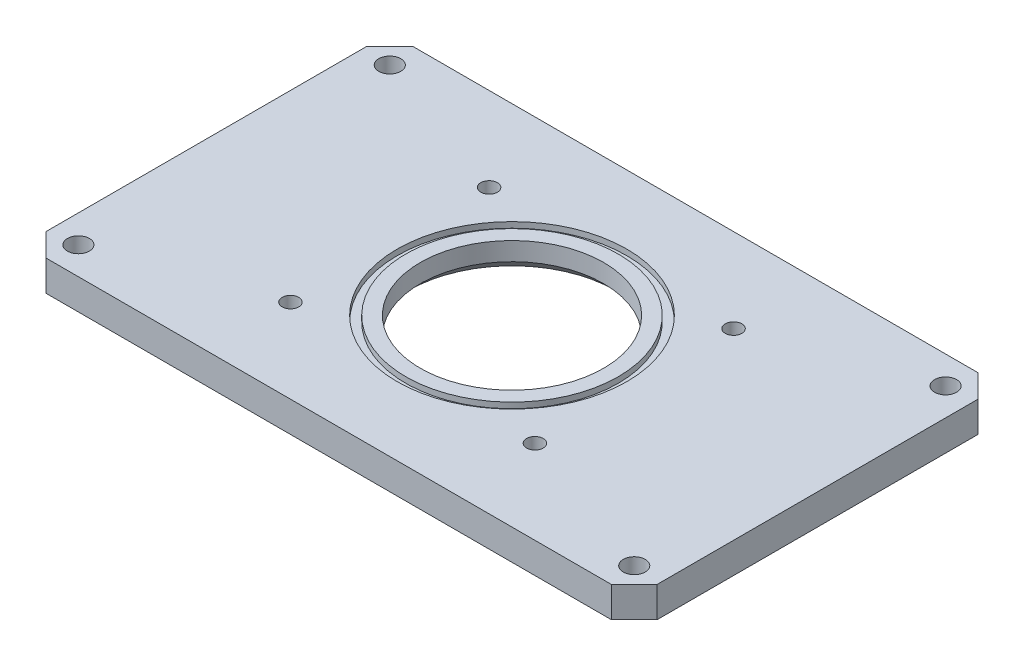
from build123d import *

# Parameters (mm, degrees)
SKETCH1_W                     = 127
SKETCH1_H                     = 76.2
BOSS_EXTRUDE1_DEPTH           = 3.175
CHAMFER1_SIZE                 = 4.7625
SKETCH7_R                     = 2.286
CUT_EXTRUDE1_DEPTH            = 75.324844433
MIRROR5_COPY_1_SKETCH_R       = 2.286
MIRROR5_COPY_1_DEPTH          = 75.324844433
CUT_EXTRUDE2_DEPTH            = 75.324844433
CUT_EXTRUDE2_DEPTH_BACK       = 75.324844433
SKETCH12_R                    = 19.05
CHAMFER2_SIZE                 = 2.54
TAP_DRILL_FOR_8_32_TAP1_D     = 3.4544
TAP_DRILL_FOR_8_32_TAP1_DEPTH = 3.81
TAP_DRILL_FOR_8_32_TAP1_TIP   = 1.037806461
SKETCH21_W                    = 1.778
SKETCH21_H                    = 1.190625


with BuildPart() as part:
    # Sketch1 → Boss-Extrude1 (new, symmetric)
    with BuildSketch(Plane(origin=(0, 0, 0), x_dir=(1, 0, 0), z_dir=(0, 1, 0))):
        Rectangle(SKETCH1_W, SKETCH1_H)
    extrude(amount=BOSS_EXTRUDE1_DEPTH, both=True)

    # Chamfer1
    chamfer1_edges = [part.edges().sort_by_distance(p)[0] for p in [
        (63.5, 0, 38.1),
        (-63.5, 0, 38.1),
        (-63.5, 0, -38.1),
        (63.5, 0, -38.1),
    ]]
    chamfer(chamfer1_edges, length=CHAMFER1_SIZE)

    # Sketch7 → Cut-Extrude1 (cut, symmetric)
    with BuildSketch(Plane(origin=(0, 3.175, 0), x_dir=(1, 0, 0), z_dir=(0, 1, 0))):
        with Locations(Location((-57.751153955, 32.351153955, 0), (0, 0, 270))):
            Circle(SKETCH7_R)
    cut_extrude1 = extrude(amount=CUT_EXTRUDE1_DEPTH, both=True, mode=Mode.SUBTRACT)

    # Mirror4: Cut-Extrude1 across plane
    add(cut_extrude1.mirror(Plane(origin=(0, 0, 0), x_dir=(0, 0, 1), z_dir=(1, 0, 0))), mode=Mode.SUBTRACT)

    # Mirror5: Cut-Extrude1 across plane
    add(cut_extrude1.mirror(Plane.XY), mode=Mode.SUBTRACT)

    # Mirror5 copy 1 sketch → Mirror5 copy 1 (cut, symmetric)
    with BuildSketch(Plane(origin=(0, 3.175, 0), x_dir=(-1, 0, 0), z_dir=(0, 1, 0))):
        with Locations(Location((-57.751153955, 32.351153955, 0), (0, 0, 270))):
            Circle(MIRROR5_COPY_1_SKETCH_R)
    extrude(amount=MIRROR5_COPY_1_DEPTH, both=True, mode=Mode.SUBTRACT)

    # Sketch12 → Cut-Extrude2 (cut, two sides: drawn at the far end of the back side and taken through both)
    with BuildSketch(Plane.XZ.offset(3.175).offset(-CUT_EXTRUDE2_DEPTH_BACK)):
        with Locations(Location((0, 0, 0), (0, 0, 270))):
            Circle(SKETCH12_R)
    extrude(amount=CUT_EXTRUDE2_DEPTH + CUT_EXTRUDE2_DEPTH_BACK, mode=Mode.SUBTRACT)

    # Chamfer2
    chamfer2_edges = [part.edges().sort_by_distance(p)[0] for p in [
        (0, -3.175, 19.05),
    ]]
    chamfer(chamfer2_edges, length=CHAMFER2_SIZE)

    # Tap Drill for _8-32 Tap1
    with Locations(Plane(origin=(-25.4, 3.175, -20.6375), x_dir=(0, 0, 1), z_dir=(0, 1, 0))):
        with Locations((0, 0), (0, 50.8), (41.275, 50.8), (41.275, 0)):
            Hole(TAP_DRILL_FOR_8_32_TAP1_D / 2, depth=TAP_DRILL_FOR_8_32_TAP1_DEPTH)
            with Locations((0, 0, -(TAP_DRILL_FOR_8_32_TAP1_DEPTH + TAP_DRILL_FOR_8_32_TAP1_TIP / 2))):  # 118° drill point
                Cone(0, TAP_DRILL_FOR_8_32_TAP1_D / 2, TAP_DRILL_FOR_8_32_TAP1_TIP, mode=Mode.SUBTRACT)

    # Sketch21 → Cut-Revolve1 (revolve, cut)
    with BuildSketch(Plane.XY):
        with Locations((22.9743, 2.5796875)):
            Rectangle(SKETCH21_W, SKETCH21_H)
    revolve(axis=Axis((0, 0, 0), (0, 1, 0)), mode=Mode.SUBTRACT)


solid = part.part
